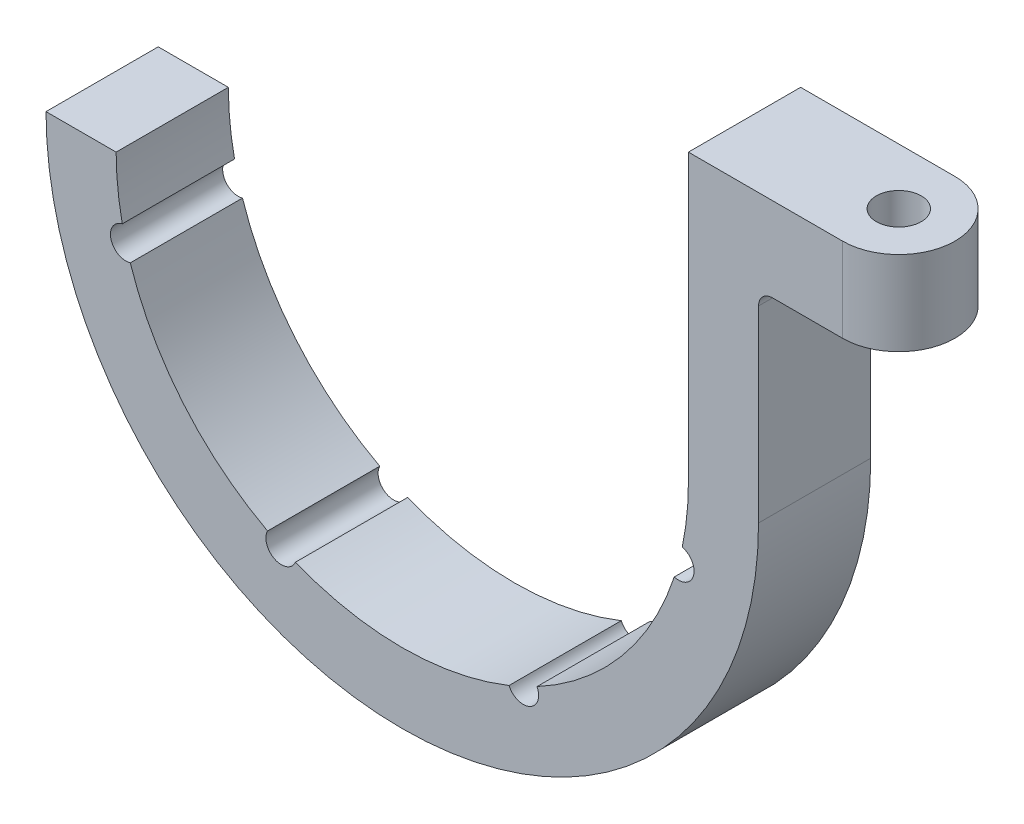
from build123d import *

# Parameters (mm, degrees)
BOSS_EXTRUDE1_DEPTH = 8
SKETCH2_R           = 1.6
BOSS_EXTRUDE2_DEPTH = 6
FILLET1_R           = 1


with BuildPart() as part:
    # Sketch1 → Boss-Extrude1 (new body)
    with BuildSketch(Plane.XY):
        with BuildLine():
            ThreePointArc((-19.960837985, -4.210100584), (-20.289912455, -2.116471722), (-20.4, 0))
            Line((-20.4, 0), (-25.4, 0))
            ThreePointArc((-25.4, 0), (0, -25.4), (25.4, 0))
            ThreePointArc((25.4, 0), (24.117628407, 7.968688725), (20.4, 15.13274595))
            Line((20.4, 15.13274595), (20.4, 0))
            ThreePointArc((20.4, 0), (20.289912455, -2.116471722), (19.960837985, -4.210100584))
            ThreePointArc((19.960837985, -4.210100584), (20.568468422, -4.598566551), (20.804886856, -5.27990852))
            ThreePointArc((20.804886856, -5.27990852), (20.362698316, -6.161545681), (19.391643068, -6.334364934))
            ThreePointArc((19.391643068, -6.334364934), (15.62730664, -13.112867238), (9.605455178, -17.99708951))
            ThreePointArc((9.605455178, -17.99708951), (9.692030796, -18.236138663), (9.72141254, -18.488678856))
            ThreePointArc((9.72141254, -18.488678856), (8.844996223, -19.565716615), (7.612302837, -18.92651171))
            ThreePointArc((7.612302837, -18.92651171), (0, -20.4), (-7.612302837, -18.92651171))
            ThreePointArc((-7.612302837, -18.92651171), (-9.086292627, -19.485617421), (-9.605455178, -17.99708951))
            ThreePointArc((-9.605455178, -17.99708951), (-15.62730664, -13.112867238), (-19.391643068, -6.334364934))
            ThreePointArc((-19.391643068, -6.334364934), (-20.767405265, -5.56460947), (-19.960837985, -4.210100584))
        make_face()
        with BuildLine():
            ThreePointArc((20.4, 15.13274595), (24.117628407, 7.968688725), (25.4, 0))
            Line((25.4, 0), (25.4, 20.4))
            Line((25.4, 20.4), (20.4, 20.4))
            Line((20.4, 20.4), (20.4, 15.13274595))
        make_face()
    extrude(amount=BOSS_EXTRUDE1_DEPTH)

    # Sketch2 → Boss-Extrude2 (add)
    with BuildSketch(Plane(origin=(0, 20.4, 0), x_dir=(1, 0, 0), z_dir=(0, 1, 0))):
        with BuildLine():
            Line((25.4, -8), (25.4, 0))
            Line((25.4, 0), (31.4, 0))
            ThreePointArc((31.4, 0), (35.4, -4), (31.4, -8))
            Line((31.4, -8), (25.4, -8))
        make_face()
        with Locations(Location((31.4, -4, 0), (0, 0, 270))):
            Circle(SKETCH2_R, mode=Mode.SUBTRACT)
    extrude(amount=-BOSS_EXTRUDE2_DEPTH)

    # Fillet1
    fillet1_edges = [part.edges().sort_by_distance(p)[0] for p in [
        (25.4, 14.4, 4),
    ]]
    fillet(fillet1_edges, radius=FILLET1_R)


solid = part.part
